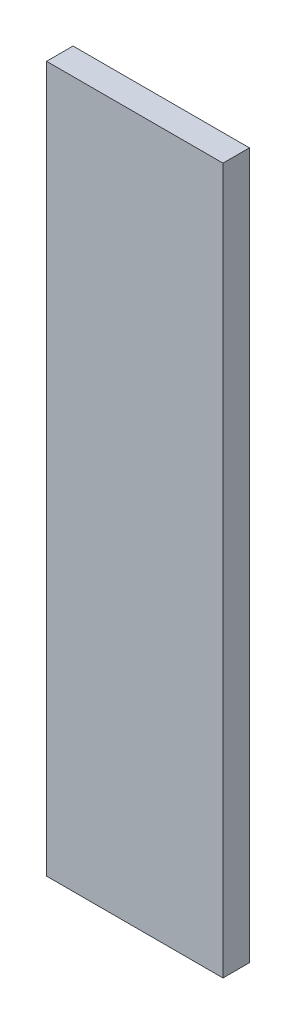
from build123d import *

# Parameters (mm, degrees)
ESQUISSE1_W      = 20
ESQUISSE1_H      = 80
EXTRUSION1_DEPTH = 3


with BuildPart() as part:
    # Esquisse1 → Extrusion1 (new body)
    with BuildSketch(Plane.XY):
        with Locations((10, 20.902272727)):
            Rectangle(ESQUISSE1_W, ESQUISSE1_H)
    extrude(amount=EXTRUSION1_DEPTH)


solid = part.part
